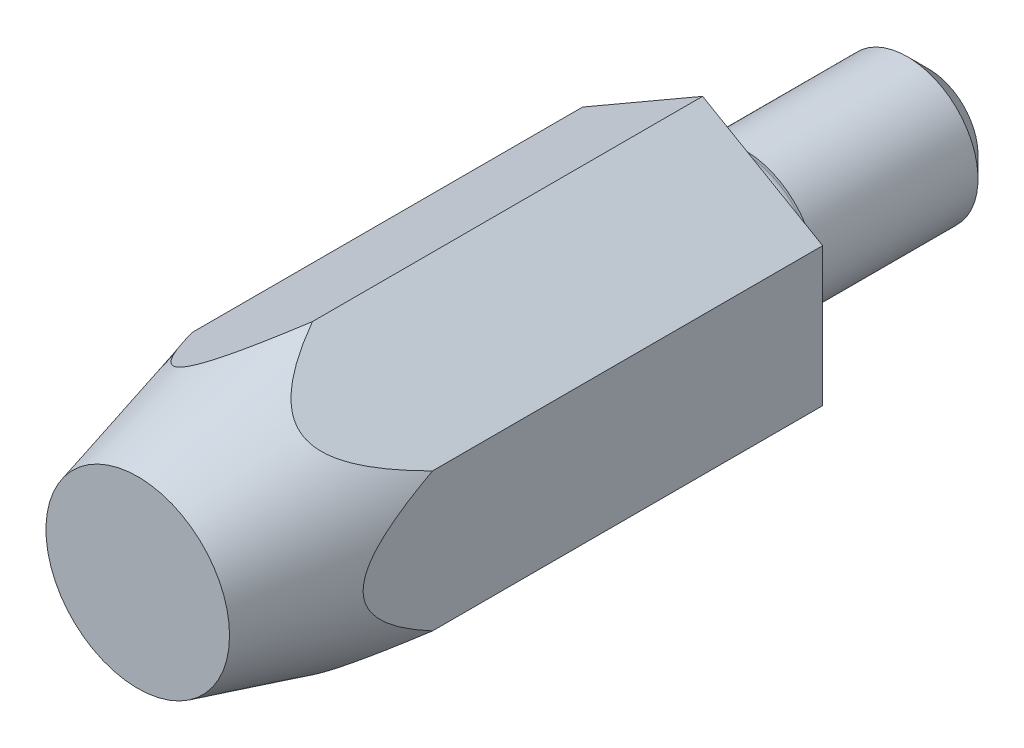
ISO-10303-21;
HEADER;
FILE_DESCRIPTION(('STEP AP214'),'2;1');
FILE_NAME('part.step','',(''),(''),'','','');
FILE_SCHEMA(('AUTOMOTIVE_DESIGN { 1 0 10303 214 1 1 1 1 }'));
ENDSEC;
DATA;
#1=APPLICATION_CONTEXT('core data for automotive mechanical design processes');
#2=APPLICATION_PROTOCOL_DEFINITION('international standard','automotive_design',2000,#1);
#3=PRODUCT_CONTEXT('',#1,'mechanical');
#4=PRODUCT('Part','Part','',(#3));
#5=PRODUCT_RELATED_PRODUCT_CATEGORY('part','',(#4));
#6=PRODUCT_DEFINITION_FORMATION('','',#4);
#7=PRODUCT_DEFINITION_CONTEXT('part definition',#1,'design');
#8=PRODUCT_DEFINITION('design','',#6,#7);
#9=PRODUCT_DEFINITION_SHAPE('','',#8);
#10=(LENGTH_UNIT() NAMED_UNIT(*) SI_UNIT(.MILLI.,.METRE.));
#11=(NAMED_UNIT(*) PLANE_ANGLE_UNIT() SI_UNIT($,.RADIAN.));
#12=(NAMED_UNIT(*) SI_UNIT($,.STERADIAN.) SOLID_ANGLE_UNIT());
#13=UNCERTAINTY_MEASURE_WITH_UNIT(LENGTH_MEASURE(1.E-05),#10,'distance_accuracy_value','');
#14=(GEOMETRIC_REPRESENTATION_CONTEXT(3) GLOBAL_UNCERTAINTY_ASSIGNED_CONTEXT((#13)) GLOBAL_UNIT_ASSIGNED_CONTEXT((#10,
#11,#12)) REPRESENTATION_CONTEXT('',''));
#15=CARTESIAN_POINT('',(0.,0.,0.));
#16=DIRECTION('',(0.,0.,1.));
#17=DIRECTION('',(1.,0.,0.));
#18=AXIS2_PLACEMENT_3D('',#15,#16,#17);
#19=CARTESIAN_POINT('',(-17.2179676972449,0.,0.));
#20=DIRECTION('',(0.,0.,-1.));
#21=DIRECTION('',(-1.,0.,0.));
#22=AXIS2_PLACEMENT_3D('',#19,#20,#21);
#23=PLANE('',#22);
#24=CARTESIAN_POINT('',(0.,0.,0.));
#25=DIRECTION('',(0.,0.,-1.));
#26=DIRECTION('',(-1.,0.,0.));
#27=AXIS2_PLACEMENT_3D('',#24,#25,#26);
#28=CIRCLE('',#27,4.8);
#29=CARTESIAN_POINT('',(-4.8,0.,0.));
#30=VERTEX_POINT('',#29);
#31=EDGE_CURVE('E22',#30,#30,#28,.F.);
#32=ORIENTED_EDGE('',*,*,#31,.T.);
#33=EDGE_LOOP('',(#32));
#34=FACE_BOUND('',#33,.T.);
#35=DIRECTION('',(0.,1.,0.));
#36=VECTOR('',#35,1.);
#37=CARTESIAN_POINT('',(8.5,-4.90747728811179,0.));
#38=LINE('',#37,#36);
#39=CARTESIAN_POINT('',(8.5,-4.90747728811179,0.));
#40=VERTEX_POINT('',#39);
#41=CARTESIAN_POINT('',(8.5,4.90747728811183,0.));
#42=VERTEX_POINT('',#41);
#43=EDGE_CURVE('E97',#40,#42,#38,.T.);
#44=ORIENTED_EDGE('',*,*,#43,.F.);
#45=DIRECTION('',(-0.866025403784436,-0.5,0.));
#46=VECTOR('',#45,1.);
#47=CARTESIAN_POINT('',(8.5,-4.90747728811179,0.));
#48=LINE('',#47,#46);
#49=CARTESIAN_POINT('',(0.,-9.81495457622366,0.));
#50=VERTEX_POINT('',#49);
#51=EDGE_CURVE('E90',#40,#50,#48,.T.);
#52=ORIENTED_EDGE('',*,*,#51,.T.);
#53=DIRECTION('',(0.866025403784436,-0.5,0.));
#54=VECTOR('',#53,1.);
#55=CARTESIAN_POINT('',(-8.5,-4.90747728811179,0.));
#56=LINE('',#55,#54);
#57=CARTESIAN_POINT('',(-8.5,-4.90747728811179,0.));
#58=VERTEX_POINT('',#57);
#59=EDGE_CURVE('E88',#58,#50,#56,.T.);
#60=ORIENTED_EDGE('',*,*,#59,.F.);
#61=DIRECTION('',(0.,1.,0.));
#62=VECTOR('',#61,1.);
#63=CARTESIAN_POINT('',(-8.5,-4.90747728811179,0.));
#64=LINE('',#63,#62);
#65=CARTESIAN_POINT('',(-8.5,4.90747728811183,0.));
#66=VERTEX_POINT('',#65);
#67=EDGE_CURVE('E37',#58,#66,#64,.T.);
#68=ORIENTED_EDGE('',*,*,#67,.T.);
#69=DIRECTION('',(0.86602540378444,0.5,0.));
#70=VECTOR('',#69,1.);
#71=CARTESIAN_POINT('',(-8.5,4.90747728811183,0.));
#72=LINE('',#71,#70);
#73=CARTESIAN_POINT('',(0.,9.81495457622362,0.));
#74=VERTEX_POINT('',#73);
#75=EDGE_CURVE('E77',#66,#74,#72,.T.);
#76=ORIENTED_EDGE('',*,*,#75,.T.);
#77=DIRECTION('',(-0.86602540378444,0.5,0.));
#78=VECTOR('',#77,1.);
#79=CARTESIAN_POINT('',(8.5,4.90747728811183,0.));
#80=LINE('',#79,#78);
#81=EDGE_CURVE('E83',#42,#74,#80,.T.);
#82=ORIENTED_EDGE('',*,*,#81,.F.);
#83=EDGE_LOOP('',(#44,#52,#60,#68,#76,#82));
#84=FACE_BOUND('',#83,.T.);
#85=ADVANCED_FACE('F14',(#34,#84),#23,.T.);
#86=CARTESIAN_POINT('',(8.5,-4.90747728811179,40.));
#87=DIRECTION('',(0.5,-0.866025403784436,0.));
#88=DIRECTION('',(0.866025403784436,0.5,0.));
#89=AXIS2_PLACEMENT_3D('',#86,#87,#88);
#90=PLANE('',#89);
#91=DIRECTION('',(0.,0.,-1.));
#92=VECTOR('',#91,1.);
#93=CARTESIAN_POINT('',(0.,-9.81495457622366,40.));
#94=LINE('',#93,#92);
#95=CARTESIAN_POINT('',(0.,-9.8149545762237,27.6284210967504));
#96=VERTEX_POINT('',#95);
#97=EDGE_CURVE('E29',#96,#50,#94,.T.);
#98=ORIENTED_EDGE('',*,*,#97,.T.);
#99=ORIENTED_EDGE('',*,*,#51,.F.);
#100=DIRECTION('',(0.,0.,-1.));
#101=VECTOR('',#100,1.);
#102=CARTESIAN_POINT('',(8.5,-4.90747728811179,40.));
#103=LINE('',#102,#101);
#104=CARTESIAN_POINT('',(8.5,-4.90747728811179,27.6284210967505));
#105=VERTEX_POINT('',#104);
#106=EDGE_CURVE('E102',#105,#40,#103,.T.);
#107=ORIENTED_EDGE('',*,*,#106,.F.);
#108=CARTESIAN_POINT('',(-0.000200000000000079,-9.8150700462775,27.6279901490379));
#109=CARTESIAN_POINT('',(0.0565623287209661,-9.7822983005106,27.7502929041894));
#110=CARTESIAN_POINT('',(0.1139809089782,-9.74914766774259,27.8721885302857));
#111=CARTESIAN_POINT('',(0.230282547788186,-9.68200088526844,28.1150576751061));
#112=CARTESIAN_POINT('',(0.289165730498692,-9.64800466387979,28.2360311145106));
#113=CARTESIAN_POINT('',(0.468440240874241,-9.54450047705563,28.597808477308));
#114=CARTESIAN_POINT('',(0.591253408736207,-9.4735942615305,28.837028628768));
#115=CARTESIAN_POINT('',(0.84635466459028,-9.32631148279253,29.31259125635));
#116=CARTESIAN_POINT('',(0.978737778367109,-9.24988005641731,29.5488660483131));
#117=CARTESIAN_POINT('',(1.25378264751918,-9.09108282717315,30.0131621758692));
#118=CARTESIAN_POINT('',(1.39643609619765,-9.00872182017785,30.2411899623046));
#119=CARTESIAN_POINT('',(1.61637758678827,-8.88173854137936,30.5679844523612));
#120=CARTESIAN_POINT('',(1.68842753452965,-8.84014048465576,30.6714546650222));
#121=CARTESIAN_POINT('',(1.83600172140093,-8.75493848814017,30.8750743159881));
#122=CARTESIAN_POINT('',(1.91152636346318,-8.71133431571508,30.9752233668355));
#123=CARTESIAN_POINT('',(2.06649578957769,-8.62186267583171,31.1713042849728));
#124=CARTESIAN_POINT('',(2.14593801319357,-8.57599668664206,31.2672388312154));
#125=CARTESIAN_POINT('',(2.3093516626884,-8.48164977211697,31.4537883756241));
#126=CARTESIAN_POINT('',(2.39332214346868,-8.43316939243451,31.5444044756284));
#127=CARTESIAN_POINT('',(2.61555054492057,-8.30486576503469,31.7683512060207));
#128=CARTESIAN_POINT('',(2.75760492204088,-8.22285063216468,31.8967851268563));
#129=CARTESIAN_POINT('',(3.05665849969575,-8.05019196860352,32.1279669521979));
#130=CARTESIAN_POINT('',(3.21361248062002,-7.95957454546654,32.2307893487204));
#131=CARTESIAN_POINT('',(3.4880775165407,-7.80111208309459,32.3698897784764));
#132=CARTESIAN_POINT('',(3.60143379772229,-7.73566580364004,32.4169283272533));
#133=CARTESIAN_POINT('',(3.83329039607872,-7.60180333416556,32.4889998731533));
#134=CARTESIAN_POINT('',(3.95178366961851,-7.53339121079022,32.5140620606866));
#135=CARTESIAN_POINT('',(4.1914950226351,-7.39499379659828,32.53911377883));
#136=CARTESIAN_POINT('',(4.31272475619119,-7.32500177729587,32.5389600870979));
#137=CARTESIAN_POINT('',(4.5531322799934,-7.18620242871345,32.5132499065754));
#138=CARTESIAN_POINT('',(4.6723087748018,-7.11739584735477,32.4876779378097));
#139=CARTESIAN_POINT('',(4.92988312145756,-6.96868522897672,32.4066601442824));
#140=CARTESIAN_POINT('',(5.06703611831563,-6.88949990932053,32.3460526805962));
#141=CARTESIAN_POINT('',(5.33126816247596,-6.73694546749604,32.2005195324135));
#142=CARTESIAN_POINT('',(5.45832337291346,-6.66359010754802,32.1155383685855));
#143=CARTESIAN_POINT('',(5.68877154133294,-6.53054079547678,31.9389162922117));
#144=CARTESIAN_POINT('',(5.79322360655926,-6.47023536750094,31.8490725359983));
#145=CARTESIAN_POINT('',(5.99515319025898,-6.35365126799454,31.65938757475));
#146=CARTESIAN_POINT('',(6.09262434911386,-6.29737626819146,31.5595374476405));
#147=CARTESIAN_POINT('',(6.28210577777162,-6.18797911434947,31.3517412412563));
#148=CARTESIAN_POINT('',(6.37407283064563,-6.13488191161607,31.243743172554));
#149=CARTESIAN_POINT('',(6.55266303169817,-6.03177281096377,31.0221313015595));
#150=CARTESIAN_POINT('',(6.63928830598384,-5.98175968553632,30.9085197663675));
#151=CARTESIAN_POINT('',(6.81304306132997,-5.88144233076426,30.6700093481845));
#152=CARTESIAN_POINT('',(6.89989417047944,-5.83129881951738,30.5448414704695));
#153=CARTESIAN_POINT('',(7.06927236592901,-5.73350827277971,30.2906504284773));
#154=CARTESIAN_POINT('',(7.15179863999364,-5.68586170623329,30.1616265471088));
#155=CARTESIAN_POINT('',(7.39403516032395,-5.54600638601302,29.769676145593));
#156=CARTESIAN_POINT('',(7.5481896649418,-5.45700524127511,29.5021724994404));
#157=CARTESIAN_POINT('',(7.83980957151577,-5.28863840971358,28.9692196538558));
#158=CARTESIAN_POINT('',(7.97768204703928,-5.20903769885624,28.7040627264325));
#159=CARTESIAN_POINT('',(8.17815750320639,-5.09329314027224,28.3027238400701));
#160=CARTESIAN_POINT('',(8.24382448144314,-5.05538029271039,28.1685667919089));
#161=CARTESIAN_POINT('',(8.37333001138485,-4.980610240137,27.8991024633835));
#162=CARTESIAN_POINT('',(8.43716879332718,-4.94375290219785,27.7637953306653));
#163=CARTESIAN_POINT('',(8.50020000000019,-4.90736181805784,27.6279901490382));
#164=B_SPLINE_CURVE_WITH_KNOTS('',3,(#108,#109,#110,#111,#112,#113,#114,#115,#116,#117,#118,
#119,#120,#121,#122,#123,#124,#125,#126,#127,#128,#129,#130,#131,#132,#133,#134,#135,#136,#137,
#138,#139,#140,#141,#142,#143,#144,#145,#146,#147,#148,#149,#150,#151,#152,#153,#154,#155,#156,
#157,#158,#159,#160,#161,#162,#163),.UNSPECIFIED.,.F.,.F.,(4,2,2,2,2,2,2,2,2,2,2,2,2,2,2,2,2,2,
2,2,2,2,2,2,2,2,2,4),(0.,0.416269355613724,0.832574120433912,1.66668109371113,2.51067143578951,
3.35398666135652,3.75221416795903,4.15048797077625,4.54850483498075,4.94643894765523,
5.56989408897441,6.19151414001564,6.60723967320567,7.02241217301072,7.43994287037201,
7.8577280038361,8.36359455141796,8.87062181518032,9.32115341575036,9.77209036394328,
10.2261980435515,10.680123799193,11.1611365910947,11.6422393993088,12.6056109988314,
13.5332254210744,13.9955173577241,14.4577508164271),.UNSPECIFIED.);
#165=EDGE_CURVE('E157',#96,#105,#164,.T.);
#166=ORIENTED_EDGE('',*,*,#165,.F.);
#167=EDGE_LOOP('',(#98,#99,#107,#166));
#168=FACE_BOUND('',#167,.T.);
#169=ADVANCED_FACE('F127',(#168),#90,.T.);
#170=CARTESIAN_POINT('',(8.5,-4.90747728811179,40.));
#171=DIRECTION('',(-1.,0.,0.));
#172=DIRECTION('',(0.,0.,1.));
#173=AXIS2_PLACEMENT_3D('',#170,#171,#172);
#174=PLANE('',#173);
#175=CARTESIAN_POINT('',(8.5,-10.0492779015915,15.1371140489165));
#176=CARTESIAN_POINT('',(8.5,-9.85410268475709,15.6931227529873));
#177=CARTESIAN_POINT('',(8.5,-9.65689373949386,16.2484272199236));
#178=CARTESIAN_POINT('',(8.5,-9.2574134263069,17.3573298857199));
#179=CARTESIAN_POINT('',(8.5,-9.05514110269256,17.9109277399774));
#180=CARTESIAN_POINT('',(8.5,-8.64297065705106,19.0203269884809));
#181=CARTESIAN_POINT('',(8.5,-8.43302447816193,19.5761105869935));
#182=CARTESIAN_POINT('',(8.5,-8.00569416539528,20.6847309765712));
#183=CARTESIAN_POINT('',(8.5,-7.78831100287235,21.2375681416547));
#184=CARTESIAN_POINT('',(8.5,-7.31428291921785,22.4138820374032));
#185=CARTESIAN_POINT('',(8.5,-7.05629847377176,23.0368236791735));
#186=CARTESIAN_POINT('',(8.5,-6.65727992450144,23.9662373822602));
#187=CARTESIAN_POINT('',(8.5,-6.52223343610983,24.2752812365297));
#188=CARTESIAN_POINT('',(8.5,-6.24742270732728,24.891263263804));
#189=CARTESIAN_POINT('',(8.5,-6.10765855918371,25.1982014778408));
#190=CARTESIAN_POINT('',(8.5,-5.8230839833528,25.8082813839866));
#191=CARTESIAN_POINT('',(8.5,-5.67829533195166,26.1114332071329));
#192=CARTESIAN_POINT('',(8.5,-5.38201744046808,26.7144414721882));
#193=CARTESIAN_POINT('',(8.5,-5.23052852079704,27.0142980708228));
#194=CARTESIAN_POINT('',(8.5,-4.91942475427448,27.6094951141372));
#195=CARTESIAN_POINT('',(8.5,-4.75981607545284,27.9048387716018));
#196=CARTESIAN_POINT('',(8.5,-4.43029545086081,28.4896960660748));
#197=CARTESIAN_POINT('',(8.5,-4.26038599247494,28.7792110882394));
#198=CARTESIAN_POINT('',(8.5,-4.0133208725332,29.1784934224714));
#199=CARTESIAN_POINT('',(8.5,-3.94177652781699,29.2917388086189));
#200=CARTESIAN_POINT('',(8.5,-3.79628704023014,29.5166832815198));
#201=CARTESIAN_POINT('',(8.5,-3.72234180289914,29.6283823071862));
#202=CARTESIAN_POINT('',(8.5,-3.49635051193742,29.960962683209));
#203=CARTESIAN_POINT('',(8.5,-3.34026820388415,30.1791320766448));
#204=CARTESIAN_POINT('',(8.5,-3.01649832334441,30.6022478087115));
#205=CARTESIAN_POINT('',(8.5,-2.84899560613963,30.8073327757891));
#206=CARTESIAN_POINT('',(8.5,-2.58473089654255,31.1031284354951));
#207=CARTESIAN_POINT('',(8.5,-2.49453248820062,31.1997003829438));
#208=CARTESIAN_POINT('',(8.5,-2.30911453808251,31.3878742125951));
#209=CARTESIAN_POINT('',(8.5,-2.2138969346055,31.4794779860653));
#210=CARTESIAN_POINT('',(8.5,-2.05038700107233,31.6268722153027));
#211=CARTESIAN_POINT('',(8.5,-1.98368987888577,31.6844287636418));
#212=CARTESIAN_POINT('',(8.5,-1.84752379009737,31.7961520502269));
#213=CARTESIAN_POINT('',(8.5,-1.77805484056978,31.8503188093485));
#214=CARTESIAN_POINT('',(8.5,-1.56493820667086,32.006937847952));
#215=CARTESIAN_POINT('',(8.5,-1.41671836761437,32.1033813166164));
#216=CARTESIAN_POINT('',(8.5,-1.10470500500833,32.2743652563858));
#217=CARTESIAN_POINT('',(8.5,-0.940703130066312,32.3485372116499));
#218=CARTESIAN_POINT('',(8.5,-0.601287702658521,32.4627994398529));
#219=CARTESIAN_POINT('',(8.5,-0.425917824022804,32.50301268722));
#220=CARTESIAN_POINT('',(8.5,-0.0937916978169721,32.5392021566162));
#221=CARTESIAN_POINT('',(8.5,0.0623969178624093,32.5402790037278));
#222=CARTESIAN_POINT('',(8.5,0.371765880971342,32.5108305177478));
#223=CARTESIAN_POINT('',(8.5,0.524943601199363,32.4802787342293));
#224=CARTESIAN_POINT('',(8.5,0.840158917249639,32.3873309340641));
#225=CARTESIAN_POINT('',(8.5,1.00120736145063,32.3216936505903));
#226=CARTESIAN_POINT('',(8.5,1.31095143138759,32.1659734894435));
#227=CARTESIAN_POINT('',(8.5,1.459620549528,32.0758398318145));
#228=CARTESIAN_POINT('',(8.5,1.73193848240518,31.8875729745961));
#229=CARTESIAN_POINT('',(8.5,1.85663291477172,31.7909153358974));
#230=CARTESIAN_POINT('',(8.5,2.09742681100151,31.5873351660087));
#231=CARTESIAN_POINT('',(8.5,2.21351826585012,31.4804032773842));
#232=CARTESIAN_POINT('',(8.5,2.43921615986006,31.258087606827));
#233=CARTESIAN_POINT('',(8.5,2.54875764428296,31.1426385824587));
#234=CARTESIAN_POINT('',(8.5,2.76135549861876,30.906071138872));
#235=CARTESIAN_POINT('',(8.5,2.86441532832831,30.7849558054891));
#236=CARTESIAN_POINT('',(8.5,3.06040356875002,30.5440656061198));
#237=CARTESIAN_POINT('',(8.5,3.15358031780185,30.4244915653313));
#238=CARTESIAN_POINT('',(8.5,3.33567224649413,30.1821333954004));
#239=CARTESIAN_POINT('',(8.5,3.42458689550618,30.0593488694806));
#240=CARTESIAN_POINT('',(8.5,3.6859133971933,29.6869848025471));
#241=CARTESIAN_POINT('',(8.5,3.8528020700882,29.4335279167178));
#242=CARTESIAN_POINT('',(8.5,4.17583930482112,28.9186833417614));
#243=CARTESIAN_POINT('',(8.5,4.33194695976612,28.6572703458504));
#244=CARTESIAN_POINT('',(8.5,4.63518718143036,28.129267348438));
#245=CARTESIAN_POINT('',(8.5,4.78231859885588,27.8626766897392));
#246=CARTESIAN_POINT('',(8.5,5.05827691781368,27.3462810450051));
#247=CARTESIAN_POINT('',(8.5,5.18764137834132,27.0967616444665));
#248=CARTESIAN_POINT('',(8.5,5.44120419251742,26.5950854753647));
#249=CARTESIAN_POINT('',(8.5,5.56540201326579,26.3429284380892));
#250=CARTESIAN_POINT('',(8.5,5.80836145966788,25.8386951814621));
#251=CARTESIAN_POINT('',(8.5,5.92716075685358,25.5866370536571));
#252=CARTESIAN_POINT('',(8.5,6.1610087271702,25.0808532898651));
#253=CARTESIAN_POINT('',(8.5,6.27605823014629,24.8271280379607));
#254=CARTESIAN_POINT('',(8.5,6.38953763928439,24.5727135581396));
#255=B_SPLINE_CURVE_WITH_KNOTS('',3,(#175,#176,#177,#178,#179,#180,#181,#182,#183,#184,#185,
#186,#187,#188,#189,#190,#191,#192,#193,#194,#195,#196,#197,#198,#199,#200,#201,#202,#203,#204,
#205,#206,#207,#208,#209,#210,#211,#212,#213,#214,#215,#216,#217,#218,#219,#220,#221,#222,#223,
#224,#225,#226,#227,#228,#229,#230,#231,#232,#233,#234,#235,#236,#237,#238,#239,#240,#241,#242,
#243,#244,#245,#246,#247,#248,#249,#250,#251,#252,#253,#254),.UNSPECIFIED.,.F.,.F.,(4,2,2,2,2,2,
2,2,2,2,2,2,2,2,2,2,2,2,2,2,2,2,2,2,2,2,2,2,2,2,2,2,2,2,2,2,2,2,2,4),(0.,1.76781912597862,
3.53597447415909,5.31827341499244,7.10034044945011,9.12289522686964,10.1346507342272,
11.1463864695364,12.1541813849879,13.1619281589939,14.16892052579,15.1756706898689,
15.5775005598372,15.9793462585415,16.7837234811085,17.5772549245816,17.9735433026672,
18.3696797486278,18.6338730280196,18.8980646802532,19.4270081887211,19.9642744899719,
20.4995867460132,20.9648417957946,21.4304862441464,21.949365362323,22.4693284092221,
22.941949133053,23.4150044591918,23.8921613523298,24.3690613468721,24.8237242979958,
25.2784437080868,26.1883916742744,27.1016215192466,28.0149680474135,28.8580823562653,
29.7012834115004,30.5372058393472,31.3729420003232),.UNSPECIFIED.);
#256=CARTESIAN_POINT('',(8.5,4.90747728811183,27.6284210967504));
#257=VERTEX_POINT('',#256);
#258=EDGE_CURVE('E151',#257,#105,#255,.F.);
#259=ORIENTED_EDGE('',*,*,#258,.T.);
#260=ORIENTED_EDGE('',*,*,#106,.T.);
#261=ORIENTED_EDGE('',*,*,#43,.T.);
#262=DIRECTION('',(0.,0.,-1.));
#263=VECTOR('',#262,1.);
#264=CARTESIAN_POINT('',(8.5,4.90747728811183,40.));
#265=LINE('',#264,#263);
#266=EDGE_CURVE('E100',#257,#42,#265,.T.);
#267=ORIENTED_EDGE('',*,*,#266,.F.);
#268=EDGE_LOOP('',(#259,#260,#261,#267));
#269=FACE_BOUND('',#268,.T.);
#270=ADVANCED_FACE('F163',(#269),#174,.F.);
#271=CARTESIAN_POINT('',(8.5,4.90747728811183,40.));
#272=DIRECTION('',(-0.5,-0.86602540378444,0.));
#273=DIRECTION('',(0.86602540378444,-0.5,0.));
#274=AXIS2_PLACEMENT_3D('',#271,#272,#273);
#275=PLANE('',#274);
#276=CARTESIAN_POINT('',(-0.000200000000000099,9.81507004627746,27.6279901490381));
#277=CARTESIAN_POINT('',(0.0565623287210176,9.78229830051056,27.7502929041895));
#278=CARTESIAN_POINT('',(0.113980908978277,9.74914766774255,27.8721885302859));
#279=CARTESIAN_POINT('',(0.230282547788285,9.6820008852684,28.1150576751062));
#280=CARTESIAN_POINT('',(0.289165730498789,9.64800466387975,28.2360311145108));
#281=CARTESIAN_POINT('',(0.468440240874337,9.54450047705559,28.5978084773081));
#282=CARTESIAN_POINT('',(0.591253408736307,9.47359426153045,28.8370286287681));
#283=CARTESIAN_POINT('',(0.84635466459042,9.32631148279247,29.3125912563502));
#284=CARTESIAN_POINT('',(0.978737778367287,9.24988005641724,29.5488660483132));
#285=CARTESIAN_POINT('',(1.25378264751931,9.09108282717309,30.0131621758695));
#286=CARTESIAN_POINT('',(1.39643609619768,9.00872182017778,30.2411899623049));
#287=CARTESIAN_POINT('',(1.61637758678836,8.8817385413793,30.5679844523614));
#288=CARTESIAN_POINT('',(1.68842753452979,8.84014048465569,30.6714546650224));
#289=CARTESIAN_POINT('',(1.83600172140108,8.75493848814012,30.8750743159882));
#290=CARTESIAN_POINT('',(1.91152636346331,8.71133431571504,30.9752233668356));
#291=CARTESIAN_POINT('',(2.0664957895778,8.62186267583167,31.1713042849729));
#292=CARTESIAN_POINT('',(2.14593801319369,8.57599668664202,31.2672388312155));
#293=CARTESIAN_POINT('',(2.30935166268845,8.48164977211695,31.4537883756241));
#294=CARTESIAN_POINT('',(2.39332214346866,8.43316939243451,31.5444044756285));
#295=CARTESIAN_POINT('',(2.6155505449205,8.30486576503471,31.7683512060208));
#296=CARTESIAN_POINT('',(2.75760492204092,8.22285063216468,31.8967851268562));
#297=CARTESIAN_POINT('',(3.05665849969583,8.0501919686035,32.1279669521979));
#298=CARTESIAN_POINT('',(3.21361248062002,7.95957454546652,32.2307893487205));
#299=CARTESIAN_POINT('',(3.48807751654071,7.80111208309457,32.3698897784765));
#300=CARTESIAN_POINT('',(3.60143379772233,7.73566580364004,32.4169283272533));
#301=CARTESIAN_POINT('',(3.83329039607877,7.60180333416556,32.4889998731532));
#302=CARTESIAN_POINT('',(3.95178366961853,7.53339121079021,32.5140620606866));
#303=CARTESIAN_POINT('',(4.19149502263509,7.39499379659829,32.53911377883));
#304=CARTESIAN_POINT('',(4.3127247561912,7.3250017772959,32.5389600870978));
#305=CARTESIAN_POINT('',(4.55313227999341,7.18620242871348,32.5132499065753));
#306=CARTESIAN_POINT('',(4.6723087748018,7.11739584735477,32.4876779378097));
#307=CARTESIAN_POINT('',(4.92988312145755,6.96868522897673,32.4066601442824));
#308=CARTESIAN_POINT('',(5.06703611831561,6.88949990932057,32.3460526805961));
#309=CARTESIAN_POINT('',(5.33126816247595,6.73694546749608,32.2005195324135));
#310=CARTESIAN_POINT('',(5.45832337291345,6.66359010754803,32.1155383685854));
#311=CARTESIAN_POINT('',(5.68877154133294,6.53054079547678,31.9389162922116));
#312=CARTESIAN_POINT('',(5.79322360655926,6.47023536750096,31.8490725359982));
#313=CARTESIAN_POINT('',(5.99515319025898,6.35365126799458,31.6593875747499));
#314=CARTESIAN_POINT('',(6.09262434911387,6.29737626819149,31.5595374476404));
#315=CARTESIAN_POINT('',(6.28210577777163,6.18797911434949,31.3517412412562));
#316=CARTESIAN_POINT('',(6.37407283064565,6.1348819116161,31.2437431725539));
#317=CARTESIAN_POINT('',(6.55266303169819,6.03177281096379,31.0221313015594));
#318=CARTESIAN_POINT('',(6.63928830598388,5.98175968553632,30.9085197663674));
#319=CARTESIAN_POINT('',(6.81304306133,5.88144233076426,30.6700093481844));
#320=CARTESIAN_POINT('',(6.89989417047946,5.8312988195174,30.5448414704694));
#321=CARTESIAN_POINT('',(7.06927236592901,5.73350827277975,30.2906504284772));
#322=CARTESIAN_POINT('',(7.15179863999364,5.68586170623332,30.1616265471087));
#323=CARTESIAN_POINT('',(7.39403516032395,5.54600638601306,29.7696761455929));
#324=CARTESIAN_POINT('',(7.54818966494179,5.45700524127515,29.5021724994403));
#325=CARTESIAN_POINT('',(7.83980957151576,5.28863840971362,28.9692196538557));
#326=CARTESIAN_POINT('',(7.97768204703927,5.20903769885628,28.7040627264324));
#327=CARTESIAN_POINT('',(8.17815750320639,5.09329314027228,28.30272384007));
#328=CARTESIAN_POINT('',(8.24382448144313,5.05538029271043,28.1685667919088));
#329=CARTESIAN_POINT('',(8.37333001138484,4.98061024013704,27.8991024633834));
#330=CARTESIAN_POINT('',(8.43716879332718,4.94375290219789,27.7637953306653));
#331=CARTESIAN_POINT('',(8.5002000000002,4.90736181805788,27.6279901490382));
#332=B_SPLINE_CURVE_WITH_KNOTS('',3,(#276,#277,#278,#279,#280,#281,#282,#283,#284,#285,#286,
#287,#288,#289,#290,#291,#292,#293,#294,#295,#296,#297,#298,#299,#300,#301,#302,#303,#304,#305,
#306,#307,#308,#309,#310,#311,#312,#313,#314,#315,#316,#317,#318,#319,#320,#321,#322,#323,#324,
#325,#326,#327,#328,#329,#330,#331),.UNSPECIFIED.,.F.,.F.,(4,2,2,2,2,2,2,2,2,2,2,2,2,2,2,2,2,2,
2,2,2,2,2,2,2,2,2,4),(0.,0.416269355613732,0.832574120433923,1.66668109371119,2.51067143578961,
3.35398666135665,3.75221416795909,4.15048797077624,4.54850483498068,4.94643894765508,
5.56989408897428,6.19151414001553,6.60723967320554,7.02241217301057,7.43994287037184,
7.85772800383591,8.36359455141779,8.87062181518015,9.3211534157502,9.77209036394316,
10.2261980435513,10.6801237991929,11.1611365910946,11.6422393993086,12.6056109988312,
13.5332254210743,13.9955173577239,14.4577508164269),.UNSPECIFIED.);
#333=CARTESIAN_POINT('',(0.,9.81495457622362,27.6284210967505));
#334=VERTEX_POINT('',#333);
#335=EDGE_CURVE('E145',#334,#257,#332,.T.);
#336=ORIENTED_EDGE('',*,*,#335,.T.);
#337=ORIENTED_EDGE('',*,*,#266,.T.);
#338=ORIENTED_EDGE('',*,*,#81,.T.);
#339=DIRECTION('',(0.,0.,-1.));
#340=VECTOR('',#339,1.);
#341=CARTESIAN_POINT('',(0.,9.81495457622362,40.));
#342=LINE('',#341,#340);
#343=EDGE_CURVE('E73',#334,#74,#342,.T.);
#344=ORIENTED_EDGE('',*,*,#343,.F.);
#345=EDGE_LOOP('',(#336,#337,#338,#344));
#346=FACE_BOUND('',#345,.T.);
#347=ADVANCED_FACE('F136',(#346),#275,.F.);
#348=CARTESIAN_POINT('',(-8.5,4.90747728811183,40.));
#349=DIRECTION('',(-0.5,0.86602540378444,0.));
#350=DIRECTION('',(-0.86602540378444,-0.5,0.));
#351=AXIS2_PLACEMENT_3D('',#348,#349,#350);
#352=PLANE('',#351);
#353=ORIENTED_EDGE('',*,*,#343,.T.);
#354=ORIENTED_EDGE('',*,*,#75,.F.);
#355=DIRECTION('',(0.,0.,-1.));
#356=VECTOR('',#355,1.);
#357=CARTESIAN_POINT('',(-8.5,4.90747728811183,40.));
#358=LINE('',#357,#356);
#359=CARTESIAN_POINT('',(-8.5,4.90747728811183,27.6284210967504));
#360=VERTEX_POINT('',#359);
#361=EDGE_CURVE('E66',#360,#66,#358,.T.);
#362=ORIENTED_EDGE('',*,*,#361,.F.);
#363=CARTESIAN_POINT('',(0.0001999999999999,9.81507004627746,27.6279901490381));
#364=CARTESIAN_POINT('',(-0.0565623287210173,9.78229830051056,27.7502929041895));
#365=CARTESIAN_POINT('',(-0.113980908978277,9.74914766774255,27.8721885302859));
#366=CARTESIAN_POINT('',(-0.230282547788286,9.6820008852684,28.1150576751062));
#367=CARTESIAN_POINT('',(-0.28916573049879,9.64800466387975,28.2360311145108));
#368=CARTESIAN_POINT('',(-0.468440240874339,9.54450047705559,28.5978084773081));
#369=CARTESIAN_POINT('',(-0.591253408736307,9.47359426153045,28.8370286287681));
#370=CARTESIAN_POINT('',(-0.84635466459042,9.32631148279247,29.3125912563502));
#371=CARTESIAN_POINT('',(-0.978737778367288,9.24988005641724,29.5488660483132));
#372=CARTESIAN_POINT('',(-1.25378264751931,9.09108282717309,30.0131621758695));
#373=CARTESIAN_POINT('',(-1.39643609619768,9.00872182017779,30.2411899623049));
#374=CARTESIAN_POINT('',(-1.61637758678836,8.88173854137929,30.5679844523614));
#375=CARTESIAN_POINT('',(-1.68842753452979,8.84014048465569,30.6714546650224));
#376=CARTESIAN_POINT('',(-1.83600172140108,8.75493848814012,30.8750743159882));
#377=CARTESIAN_POINT('',(-1.91152636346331,8.71133431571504,30.9752233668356));
#378=CARTESIAN_POINT('',(-2.0664957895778,8.62186267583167,31.1713042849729));
#379=CARTESIAN_POINT('',(-2.14593801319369,8.57599668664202,31.2672388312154));
#380=CARTESIAN_POINT('',(-2.30935166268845,8.48164977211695,31.4537883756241));
#381=CARTESIAN_POINT('',(-2.39332214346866,8.43316939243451,31.5444044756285));
#382=CARTESIAN_POINT('',(-2.6155505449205,8.30486576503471,31.7683512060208));
#383=CARTESIAN_POINT('',(-2.75760492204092,8.22285063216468,31.8967851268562));
#384=CARTESIAN_POINT('',(-3.05665849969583,8.0501919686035,32.1279669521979));
#385=CARTESIAN_POINT('',(-3.21361248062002,7.95957454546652,32.2307893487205));
#386=CARTESIAN_POINT('',(-3.48807751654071,7.80111208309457,32.3698897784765));
#387=CARTESIAN_POINT('',(-3.60143379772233,7.73566580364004,32.4169283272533));
#388=CARTESIAN_POINT('',(-3.83329039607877,7.60180333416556,32.4889998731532));
#389=CARTESIAN_POINT('',(-3.95178366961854,7.53339121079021,32.5140620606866));
#390=CARTESIAN_POINT('',(-4.1914950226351,7.39499379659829,32.53911377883));
#391=CARTESIAN_POINT('',(-4.3127247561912,7.32500177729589,32.5389600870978));
#392=CARTESIAN_POINT('',(-4.55313227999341,7.18620242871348,32.5132499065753));
#393=CARTESIAN_POINT('',(-4.67230877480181,7.11739584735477,32.4876779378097));
#394=CARTESIAN_POINT('',(-4.92988312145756,6.96868522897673,32.4066601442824));
#395=CARTESIAN_POINT('',(-5.06703611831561,6.88949990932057,32.3460526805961));
#396=CARTESIAN_POINT('',(-5.33126816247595,6.73694546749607,32.2005195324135));
#397=CARTESIAN_POINT('',(-5.45832337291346,6.66359010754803,32.1155383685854));
#398=CARTESIAN_POINT('',(-5.68877154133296,6.53054079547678,31.9389162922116));
#399=CARTESIAN_POINT('',(-5.79322360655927,6.47023536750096,31.8490725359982));
#400=CARTESIAN_POINT('',(-5.99515319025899,6.35365126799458,31.6593875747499));
#401=CARTESIAN_POINT('',(-6.09262434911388,6.29737626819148,31.5595374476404));
#402=CARTESIAN_POINT('',(-6.28210577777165,6.18797911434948,31.3517412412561));
#403=CARTESIAN_POINT('',(-6.37407283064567,6.13488191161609,31.2437431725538));
#404=CARTESIAN_POINT('',(-6.55266303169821,6.03177281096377,31.0221313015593));
#405=CARTESIAN_POINT('',(-6.63928830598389,5.98175968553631,30.9085197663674));
#406=CARTESIAN_POINT('',(-6.81304306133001,5.88144233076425,30.6700093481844));
#407=CARTESIAN_POINT('',(-6.89989417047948,5.83129881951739,30.5448414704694));
#408=CARTESIAN_POINT('',(-7.06927236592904,5.73350827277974,30.2906504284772));
#409=CARTESIAN_POINT('',(-7.15179863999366,5.68586170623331,30.1616265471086));
#410=CARTESIAN_POINT('',(-7.39403516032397,5.54600638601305,29.7696761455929));
#411=CARTESIAN_POINT('',(-7.54818966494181,5.45700524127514,29.5021724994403));
#412=CARTESIAN_POINT('',(-7.83980957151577,5.28863840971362,28.9692196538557));
#413=CARTESIAN_POINT('',(-7.97768204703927,5.20903769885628,28.7040627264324));
#414=CARTESIAN_POINT('',(-8.17815750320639,5.09329314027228,28.30272384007));
#415=CARTESIAN_POINT('',(-8.24382448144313,5.05538029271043,28.1685667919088));
#416=CARTESIAN_POINT('',(-8.37333001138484,4.98061024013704,27.8991024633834));
#417=CARTESIAN_POINT('',(-8.43716879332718,4.94375290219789,27.7637953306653));
#418=CARTESIAN_POINT('',(-8.50020000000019,4.90736181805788,27.6279901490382));
#419=B_SPLINE_CURVE_WITH_KNOTS('',3,(#363,#364,#365,#366,#367,#368,#369,#370,#371,#372,#373,
#374,#375,#376,#377,#378,#379,#380,#381,#382,#383,#384,#385,#386,#387,#388,#389,#390,#391,#392,
#393,#394,#395,#396,#397,#398,#399,#400,#401,#402,#403,#404,#405,#406,#407,#408,#409,#410,#411,
#412,#413,#414,#415,#416,#417,#418),.UNSPECIFIED.,.F.,.F.,(4,2,2,2,2,2,2,2,2,2,2,2,2,2,2,2,2,2,
2,2,2,2,2,2,2,2,2,4),(0.,0.416269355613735,0.832574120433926,1.66668109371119,2.51067143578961,
3.35398666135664,3.75221416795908,4.15048797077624,4.54850483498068,4.94643894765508,
5.56989408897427,6.19151414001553,6.60723967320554,7.02241217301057,7.43994287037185,
7.85772800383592,8.36359455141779,8.87062181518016,9.32115341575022,9.77209036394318,
10.2261980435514,10.6801237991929,11.1611365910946,11.6422393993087,12.6056109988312,
13.5332254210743,13.9955173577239,14.4577508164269),.UNSPECIFIED.);
#420=EDGE_CURVE('E139',#334,#360,#419,.T.);
#421=ORIENTED_EDGE('',*,*,#420,.F.);
#422=EDGE_LOOP('',(#353,#354,#362,#421));
#423=FACE_BOUND('',#422,.T.);
#424=ADVANCED_FACE('F78',(#423),#352,.T.);
#425=CARTESIAN_POINT('',(-8.5,-4.90747728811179,40.));
#426=DIRECTION('',(-1.,0.,0.));
#427=DIRECTION('',(0.,0.,1.));
#428=AXIS2_PLACEMENT_3D('',#425,#426,#427);
#429=PLANE('',#428);
#430=ORIENTED_EDGE('',*,*,#361,.T.);
#431=ORIENTED_EDGE('',*,*,#67,.F.);
#432=DIRECTION('',(0.,0.,-1.));
#433=VECTOR('',#432,1.);
#434=CARTESIAN_POINT('',(-8.5,-4.90747728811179,40.));
#435=LINE('',#434,#433);
#436=CARTESIAN_POINT('',(-8.5,-4.90747728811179,27.6284210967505));
#437=VERTEX_POINT('',#436);
#438=EDGE_CURVE('E74',#437,#58,#435,.T.);
#439=ORIENTED_EDGE('',*,*,#438,.F.);
#440=CARTESIAN_POINT('',(-8.5,-10.0492779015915,15.1371140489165));
#441=CARTESIAN_POINT('',(-8.5,-9.85410268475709,15.6931227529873));
#442=CARTESIAN_POINT('',(-8.5,-9.65689373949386,16.2484272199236));
#443=CARTESIAN_POINT('',(-8.5,-9.2574134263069,17.3573298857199));
#444=CARTESIAN_POINT('',(-8.5,-9.05514110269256,17.9109277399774));
#445=CARTESIAN_POINT('',(-8.5,-8.64297065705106,19.0203269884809));
#446=CARTESIAN_POINT('',(-8.5,-8.43302447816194,19.5761105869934));
#447=CARTESIAN_POINT('',(-8.5,-8.00569416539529,20.6847309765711));
#448=CARTESIAN_POINT('',(-8.5,-7.78831100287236,21.2375681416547));
#449=CARTESIAN_POINT('',(-8.5,-7.31428291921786,22.4138820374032));
#450=CARTESIAN_POINT('',(-8.5,-7.05629847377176,23.0368236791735));
#451=CARTESIAN_POINT('',(-8.5,-6.65727992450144,23.9662373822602));
#452=CARTESIAN_POINT('',(-8.5,-6.52223343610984,24.2752812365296));
#453=CARTESIAN_POINT('',(-8.5,-6.24742270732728,24.891263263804));
#454=CARTESIAN_POINT('',(-8.5,-6.10765855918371,25.1982014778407));
#455=CARTESIAN_POINT('',(-8.5,-5.82308398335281,25.8082813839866));
#456=CARTESIAN_POINT('',(-8.5,-5.67829533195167,26.1114332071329));
#457=CARTESIAN_POINT('',(-8.5,-5.38201744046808,26.7144414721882));
#458=CARTESIAN_POINT('',(-8.5,-5.23052852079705,27.0142980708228));
#459=CARTESIAN_POINT('',(-8.5,-4.91942475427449,27.6094951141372));
#460=CARTESIAN_POINT('',(-8.5,-4.75981607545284,27.9048387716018));
#461=CARTESIAN_POINT('',(-8.5,-4.43029545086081,28.4896960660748));
#462=CARTESIAN_POINT('',(-8.5,-4.26038599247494,28.7792110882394));
#463=CARTESIAN_POINT('',(-8.5,-4.01332087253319,29.1784934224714));
#464=CARTESIAN_POINT('',(-8.5,-3.94177652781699,29.2917388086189));
#465=CARTESIAN_POINT('',(-8.5,-3.79628704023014,29.5166832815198));
#466=CARTESIAN_POINT('',(-8.5,-3.72234180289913,29.6283823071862));
#467=CARTESIAN_POINT('',(-8.5,-3.49635051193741,29.9609626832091));
#468=CARTESIAN_POINT('',(-8.5,-3.34026820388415,30.1791320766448));
#469=CARTESIAN_POINT('',(-8.5,-3.0164983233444,30.6022478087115));
#470=CARTESIAN_POINT('',(-8.5,-2.84899560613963,30.8073327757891));
#471=CARTESIAN_POINT('',(-8.5,-2.58473089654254,31.1031284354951));
#472=CARTESIAN_POINT('',(-8.5,-2.49453248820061,31.1997003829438));
#473=CARTESIAN_POINT('',(-8.5,-2.30911453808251,31.3878742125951));
#474=CARTESIAN_POINT('',(-8.5,-2.2138969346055,31.4794779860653));
#475=CARTESIAN_POINT('',(-8.5,-2.05038700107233,31.6268722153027));
#476=CARTESIAN_POINT('',(-8.5,-1.98368987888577,31.6844287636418));
#477=CARTESIAN_POINT('',(-8.5,-1.84752379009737,31.7961520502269));
#478=CARTESIAN_POINT('',(-8.5,-1.77805484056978,31.8503188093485));
#479=CARTESIAN_POINT('',(-8.5,-1.56493820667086,32.006937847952));
#480=CARTESIAN_POINT('',(-8.5,-1.41671836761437,32.1033813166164));
#481=CARTESIAN_POINT('',(-8.5,-1.10470500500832,32.2743652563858));
#482=CARTESIAN_POINT('',(-8.5,-0.940703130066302,32.3485372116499));
#483=CARTESIAN_POINT('',(-8.5,-0.601287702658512,32.4627994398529));
#484=CARTESIAN_POINT('',(-8.5,-0.425917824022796,32.50301268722));
#485=CARTESIAN_POINT('',(-8.5,-0.0937916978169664,32.5392021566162));
#486=CARTESIAN_POINT('',(-8.5,0.0623969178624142,32.5402790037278));
#487=CARTESIAN_POINT('',(-8.5,0.371765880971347,32.5108305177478));
#488=CARTESIAN_POINT('',(-8.5,0.524943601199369,32.4802787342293));
#489=CARTESIAN_POINT('',(-8.5,0.840158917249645,32.3873309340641));
#490=CARTESIAN_POINT('',(-8.5,1.00120736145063,32.3216936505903));
#491=CARTESIAN_POINT('',(-8.5,1.3109514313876,32.1659734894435));
#492=CARTESIAN_POINT('',(-8.5,1.45962054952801,32.0758398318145));
#493=CARTESIAN_POINT('',(-8.5,1.73193848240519,31.8875729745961));
#494=CARTESIAN_POINT('',(-8.5,1.85663291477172,31.7909153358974));
#495=CARTESIAN_POINT('',(-8.5,2.09742681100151,31.5873351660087));
#496=CARTESIAN_POINT('',(-8.5,2.21351826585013,31.4804032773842));
#497=CARTESIAN_POINT('',(-8.5,2.43921615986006,31.258087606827));
#498=CARTESIAN_POINT('',(-8.5,2.54875764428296,31.1426385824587));
#499=CARTESIAN_POINT('',(-8.5,2.76135549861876,30.906071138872));
#500=CARTESIAN_POINT('',(-8.5,2.86441532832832,30.7849558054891));
#501=CARTESIAN_POINT('',(-8.5,3.06040356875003,30.5440656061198));
#502=CARTESIAN_POINT('',(-8.5,3.15358031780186,30.4244915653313));
#503=CARTESIAN_POINT('',(-8.5,3.33567224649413,30.1821333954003));
#504=CARTESIAN_POINT('',(-8.5,3.42458689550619,30.0593488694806));
#505=CARTESIAN_POINT('',(-8.5,3.68591339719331,29.686984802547));
#506=CARTESIAN_POINT('',(-8.5,3.85280207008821,29.4335279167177));
#507=CARTESIAN_POINT('',(-8.5,4.17583930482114,28.9186833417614));
#508=CARTESIAN_POINT('',(-8.5,4.33194695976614,28.6572703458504));
#509=CARTESIAN_POINT('',(-8.5,4.63518718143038,28.1292673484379));
#510=CARTESIAN_POINT('',(-8.5,4.78231859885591,27.8626766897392));
#511=CARTESIAN_POINT('',(-8.5,5.05827691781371,27.3462810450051));
#512=CARTESIAN_POINT('',(-8.5,5.18764137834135,27.0967616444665));
#513=CARTESIAN_POINT('',(-8.5,5.44120419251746,26.5950854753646));
#514=CARTESIAN_POINT('',(-8.5,5.56540201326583,26.3429284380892));
#515=CARTESIAN_POINT('',(-8.5,5.80836145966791,25.838695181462));
#516=CARTESIAN_POINT('',(-8.5,5.92716075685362,25.586637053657));
#517=CARTESIAN_POINT('',(-8.5,6.16100872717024,25.080853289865));
#518=CARTESIAN_POINT('',(-8.5,6.27605823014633,24.8271280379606));
#519=CARTESIAN_POINT('',(-8.5,6.38953763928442,24.5727135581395));
#520=B_SPLINE_CURVE_WITH_KNOTS('',3,(#440,#441,#442,#443,#444,#445,#446,#447,#448,#449,#450,
#451,#452,#453,#454,#455,#456,#457,#458,#459,#460,#461,#462,#463,#464,#465,#466,#467,#468,#469,
#470,#471,#472,#473,#474,#475,#476,#477,#478,#479,#480,#481,#482,#483,#484,#485,#486,#487,#488,
#489,#490,#491,#492,#493,#494,#495,#496,#497,#498,#499,#500,#501,#502,#503,#504,#505,#506,#507,
#508,#509,#510,#511,#512,#513,#514,#515,#516,#517,#518,#519),.UNSPECIFIED.,.F.,.F.,(4,2,2,2,2,2,
2,2,2,2,2,2,2,2,2,2,2,2,2,2,2,2,2,2,2,2,2,2,2,2,2,2,2,2,2,2,2,2,2,4),(0.,1.76781912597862,
3.53597447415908,5.31827341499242,7.10034044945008,9.12289522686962,10.1346507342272,
11.1463864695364,12.1541813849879,13.1619281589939,14.16892052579,15.1756706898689,
15.5775005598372,15.9793462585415,16.7837234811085,17.5772549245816,17.9735433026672,
18.3696797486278,18.6338730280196,18.8980646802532,19.4270081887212,19.9642744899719,
20.4995867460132,20.9648417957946,21.4304862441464,21.949365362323,22.4693284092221,
22.941949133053,23.4150044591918,23.8921613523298,24.3690613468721,24.8237242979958,
25.2784437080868,26.1883916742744,27.1016215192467,28.0149680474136,28.8580823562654,
29.7012834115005,30.5372058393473,31.3729420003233),.UNSPECIFIED.);
#521=EDGE_CURVE('E70',#360,#437,#520,.F.);
#522=ORIENTED_EDGE('',*,*,#521,.F.);
#523=EDGE_LOOP('',(#430,#431,#439,#522));
#524=FACE_BOUND('',#523,.T.);
#525=ADVANCED_FACE('F68',(#524),#429,.T.);
#526=CARTESIAN_POINT('',(-8.5,-4.90747728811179,40.));
#527=DIRECTION('',(0.5,0.866025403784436,0.));
#528=DIRECTION('',(-0.866025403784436,0.5,0.));
#529=AXIS2_PLACEMENT_3D('',#526,#527,#528);
#530=PLANE('',#529);
#531=CARTESIAN_POINT('',(0.000199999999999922,-9.8150700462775,27.6279901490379));
#532=CARTESIAN_POINT('',(-0.0565623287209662,-9.7822983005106,27.7502929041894));
#533=CARTESIAN_POINT('',(-0.1139809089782,-9.74914766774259,27.8721885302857));
#534=CARTESIAN_POINT('',(-0.230282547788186,-9.68200088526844,28.1150576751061));
#535=CARTESIAN_POINT('',(-0.289165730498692,-9.64800466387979,28.2360311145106));
#536=CARTESIAN_POINT('',(-0.46844024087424,-9.54450047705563,28.597808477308));
#537=CARTESIAN_POINT('',(-0.591253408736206,-9.4735942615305,28.837028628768));
#538=CARTESIAN_POINT('',(-0.846354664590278,-9.32631148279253,29.31259125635));
#539=CARTESIAN_POINT('',(-0.978737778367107,-9.2498800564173,29.5488660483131));
#540=CARTESIAN_POINT('',(-1.25378264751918,-9.09108282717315,30.0131621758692));
#541=CARTESIAN_POINT('',(-1.39643609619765,-9.00872182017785,30.2411899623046));
#542=CARTESIAN_POINT('',(-1.61637758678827,-8.88173854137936,30.5679844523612));
#543=CARTESIAN_POINT('',(-1.68842753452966,-8.84014048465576,30.6714546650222));
#544=CARTESIAN_POINT('',(-1.83600172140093,-8.75493848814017,30.8750743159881));
#545=CARTESIAN_POINT('',(-1.91152636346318,-8.71133431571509,30.9752233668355));
#546=CARTESIAN_POINT('',(-2.06649578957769,-8.62186267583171,31.1713042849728));
#547=CARTESIAN_POINT('',(-2.14593801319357,-8.57599668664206,31.2672388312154));
#548=CARTESIAN_POINT('',(-2.3093516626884,-8.48164977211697,31.4537883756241));
#549=CARTESIAN_POINT('',(-2.39332214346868,-8.43316939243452,31.5444044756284));
#550=CARTESIAN_POINT('',(-2.61555054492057,-8.3048657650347,31.7683512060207));
#551=CARTESIAN_POINT('',(-2.75760492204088,-8.22285063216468,31.8967851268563));
#552=CARTESIAN_POINT('',(-3.05665849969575,-8.05019196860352,32.1279669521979));
#553=CARTESIAN_POINT('',(-3.21361248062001,-7.95957454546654,32.2307893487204));
#554=CARTESIAN_POINT('',(-3.4880775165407,-7.80111208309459,32.3698897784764));
#555=CARTESIAN_POINT('',(-3.60143379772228,-7.73566580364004,32.4169283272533));
#556=CARTESIAN_POINT('',(-3.83329039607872,-7.60180333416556,32.4889998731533));
#557=CARTESIAN_POINT('',(-3.95178366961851,-7.53339121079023,32.5140620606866));
#558=CARTESIAN_POINT('',(-4.1914950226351,-7.39499379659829,32.53911377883));
#559=CARTESIAN_POINT('',(-4.31272475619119,-7.32500177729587,32.5389600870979));
#560=CARTESIAN_POINT('',(-4.5531322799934,-7.18620242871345,32.5132499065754));
#561=CARTESIAN_POINT('',(-4.6723087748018,-7.11739584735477,32.4876779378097));
#562=CARTESIAN_POINT('',(-4.92988312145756,-6.96868522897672,32.4066601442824));
#563=CARTESIAN_POINT('',(-5.06703611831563,-6.88949990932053,32.3460526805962));
#564=CARTESIAN_POINT('',(-5.33126816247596,-6.73694546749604,32.2005195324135));
#565=CARTESIAN_POINT('',(-5.45832337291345,-6.66359010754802,32.1155383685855));
#566=CARTESIAN_POINT('',(-5.68877154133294,-6.53054079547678,31.9389162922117));
#567=CARTESIAN_POINT('',(-5.79322360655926,-6.47023536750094,31.8490725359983));
#568=CARTESIAN_POINT('',(-5.99515319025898,-6.35365126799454,31.65938757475));
#569=CARTESIAN_POINT('',(-6.09262434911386,-6.29737626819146,31.5595374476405));
#570=CARTESIAN_POINT('',(-6.28210577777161,-6.18797911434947,31.3517412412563));
#571=CARTESIAN_POINT('',(-6.37407283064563,-6.13488191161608,31.243743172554));
#572=CARTESIAN_POINT('',(-6.55266303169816,-6.03177281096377,31.0221313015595));
#573=CARTESIAN_POINT('',(-6.63928830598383,-5.98175968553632,30.9085197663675));
#574=CARTESIAN_POINT('',(-6.81304306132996,-5.88144233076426,30.6700093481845));
#575=CARTESIAN_POINT('',(-6.89989417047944,-5.83129881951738,30.5448414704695));
#576=CARTESIAN_POINT('',(-7.06927236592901,-5.73350827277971,30.2906504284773));
#577=CARTESIAN_POINT('',(-7.15179863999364,-5.68586170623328,30.1616265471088));
#578=CARTESIAN_POINT('',(-7.39403516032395,-5.54600638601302,29.769676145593));
#579=CARTESIAN_POINT('',(-7.5481896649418,-5.45700524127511,29.5021724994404));
#580=CARTESIAN_POINT('',(-7.83980957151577,-5.28863840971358,28.9692196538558));
#581=CARTESIAN_POINT('',(-7.97768204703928,-5.20903769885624,28.7040627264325));
#582=CARTESIAN_POINT('',(-8.17815750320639,-5.09329314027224,28.30272384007));
#583=CARTESIAN_POINT('',(-8.24382448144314,-5.05538029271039,28.1685667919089));
#584=CARTESIAN_POINT('',(-8.37333001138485,-4.980610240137,27.8991024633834));
#585=CARTESIAN_POINT('',(-8.43716879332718,-4.94375290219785,27.7637953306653));
#586=CARTESIAN_POINT('',(-8.5002000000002,-4.90736181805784,27.6279901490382));
#587=B_SPLINE_CURVE_WITH_KNOTS('',3,(#531,#532,#533,#534,#535,#536,#537,#538,#539,#540,#541,
#542,#543,#544,#545,#546,#547,#548,#549,#550,#551,#552,#553,#554,#555,#556,#557,#558,#559,#560,
#561,#562,#563,#564,#565,#566,#567,#568,#569,#570,#571,#572,#573,#574,#575,#576,#577,#578,#579,
#580,#581,#582,#583,#584,#585,#586),.UNSPECIFIED.,.F.,.F.,(4,2,2,2,2,2,2,2,2,2,2,2,2,2,2,2,2,2,
2,2,2,2,2,2,2,2,2,4),(0.,0.416269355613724,0.832574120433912,1.66668109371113,2.51067143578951,
3.35398666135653,3.75221416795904,4.15048797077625,4.54850483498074,4.94643894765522,
5.5698940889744,6.19151414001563,6.60723967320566,7.02241217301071,7.43994287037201,
7.8577280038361,8.36359455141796,8.87062181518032,9.32115341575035,9.77209036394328,
10.2261980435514,10.680123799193,11.1611365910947,11.6422393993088,12.6056109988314,
13.5332254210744,13.9955173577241,14.4577508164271),.UNSPECIFIED.);
#588=EDGE_CURVE('E104',#96,#437,#587,.T.);
#589=ORIENTED_EDGE('',*,*,#588,.T.);
#590=ORIENTED_EDGE('',*,*,#438,.T.);
#591=ORIENTED_EDGE('',*,*,#59,.T.);
#592=ORIENTED_EDGE('',*,*,#97,.F.);
#593=EDGE_LOOP('',(#589,#590,#591,#592));
#594=FACE_BOUND('',#593,.T.);
#595=ADVANCED_FACE('F122',(#594),#530,.F.);
#596=CARTESIAN_POINT('',(0.,0.,40.));
#597=DIRECTION('',(0.,0.,1.));
#598=DIRECTION('',(1.,0.,0.));
#599=AXIS2_PLACEMENT_3D('',#596,#597,#598);
#600=PLANE('',#599);
#601=CARTESIAN_POINT('',(0.,0.,40.));
#602=DIRECTION('',(0.,0.,1.));
#603=DIRECTION('',(1.,0.,0.));
#604=AXIS2_PLACEMENT_3D('',#601,#602,#603);
#605=CIRCLE('',#604,6.5);
#606=CARTESIAN_POINT('',(6.5,0.,40.));
#607=VERTEX_POINT('',#606);
#608=EDGE_CURVE('E202',#607,#607,#605,.T.);
#609=ORIENTED_EDGE('',*,*,#608,.T.);
#610=EDGE_LOOP('',(#609));
#611=FACE_BOUND('',#610,.T.);
#612=ADVANCED_FACE('F126',(#611),#600,.T.);
#613=CARTESIAN_POINT('',(0.,0.,40.));
#614=DIRECTION('',(0.,0.,-1.));
#615=DIRECTION('',(-1.,0.,0.));
#616=AXIS2_PLACEMENT_3D('',#613,#614,#615);
#617=CONICAL_SURFACE('',#616,6.5,0.26179938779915);
#618=ORIENTED_EDGE('',*,*,#608,.F.);
#619=EDGE_LOOP('',(#618));
#620=FACE_BOUND('',#619,.T.);
#621=ORIENTED_EDGE('',*,*,#588,.F.);
#622=ORIENTED_EDGE('',*,*,#165,.T.);
#623=ORIENTED_EDGE('',*,*,#258,.F.);
#624=ORIENTED_EDGE('',*,*,#335,.F.);
#625=ORIENTED_EDGE('',*,*,#420,.T.);
#626=ORIENTED_EDGE('',*,*,#521,.T.);
#627=EDGE_LOOP('',(#621,#622,#623,#624,#625,#626));
#628=FACE_BOUND('',#627,.T.);
#629=ADVANCED_FACE('F118',(#620,#628),#617,.T.);
#630=CARTESIAN_POINT('',(0.,0.,-3.));
#631=DIRECTION('',(0.,0.,-1.));
#632=DIRECTION('',(-1.,0.,0.));
#633=AXIS2_PLACEMENT_3D('',#630,#631,#632);
#634=PLANE('',#633);
#635=CARTESIAN_POINT('',(0.,0.,-3.));
#636=DIRECTION('',(0.,0.,-1.));
#637=DIRECTION('',(-1.,0.,0.));
#638=AXIS2_PLACEMENT_3D('',#635,#636,#637);
#639=CIRCLE('',#638,4.8);
#640=CARTESIAN_POINT('',(-4.8,0.,-3.));
#641=VERTEX_POINT('',#640);
#642=EDGE_CURVE('E9',#641,#641,#639,.T.);
#643=ORIENTED_EDGE('',*,*,#642,.T.);
#644=EDGE_LOOP('',(#643));
#645=FACE_BOUND('',#644,.T.);
#646=CARTESIAN_POINT('',(0.,0.,-3.));
#647=DIRECTION('',(0.,0.,-1.));
#648=DIRECTION('',(-1.,0.,0.));
#649=AXIS2_PLACEMENT_3D('',#646,#647,#648);
#650=CIRCLE('',#649,5.);
#651=CARTESIAN_POINT('',(-5.,0.,-3.));
#652=VERTEX_POINT('',#651);
#653=EDGE_CURVE('E95',#652,#652,#650,.F.);
#654=ORIENTED_EDGE('',*,*,#653,.T.);
#655=EDGE_LOOP('',(#654));
#656=FACE_BOUND('',#655,.T.);
#657=ADVANCED_FACE('F252',(#645,#656),#634,.F.);
#658=CARTESIAN_POINT('',(0.,0.,-3.));
#659=DIRECTION('',(0.,0.,1.));
#660=DIRECTION('',(1.,0.,0.));
#661=AXIS2_PLACEMENT_3D('',#658,#659,#660);
#662=CYLINDRICAL_SURFACE('',#661,4.);
#663=CARTESIAN_POINT('',(0.,0.,-0.8));
#664=DIRECTION('',(0.,0.,-1.));
#665=DIRECTION('',(-1.,0.,0.));
#666=AXIS2_PLACEMENT_3D('',#663,#664,#665);
#667=CIRCLE('',#666,4.);
#668=CARTESIAN_POINT('',(-4.,0.,-0.8));
#669=VERTEX_POINT('',#668);
#670=EDGE_CURVE('E188',#669,#669,#667,.T.);
#671=ORIENTED_EDGE('',*,*,#670,.T.);
#672=EDGE_LOOP('',(#671));
#673=FACE_BOUND('',#672,.T.);
#674=CARTESIAN_POINT('',(0.,0.,-2.2));
#675=DIRECTION('',(0.,0.,-1.));
#676=DIRECTION('',(-1.,0.,0.));
#677=AXIS2_PLACEMENT_3D('',#674,#675,#676);
#678=CIRCLE('',#677,4.);
#679=CARTESIAN_POINT('',(-4.,0.,-2.2));
#680=VERTEX_POINT('',#679);
#681=EDGE_CURVE('E190',#680,#680,#678,.F.);
#682=ORIENTED_EDGE('',*,*,#681,.T.);
#683=EDGE_LOOP('',(#682));
#684=FACE_BOUND('',#683,.T.);
#685=ADVANCED_FACE('F172',(#673,#684),#662,.T.);
#686=CARTESIAN_POINT('',(-5.,0.,-16.));
#687=DIRECTION('',(0.,0.,-1.));
#688=DIRECTION('',(-1.,0.,0.));
#689=AXIS2_PLACEMENT_3D('',#686,#687,#688);
#690=PLANE('',#689);
#691=CARTESIAN_POINT('',(0.,0.,-16.));
#692=DIRECTION('',(0.,0.,-1.));
#693=DIRECTION('',(-1.,0.,0.));
#694=AXIS2_PLACEMENT_3D('',#691,#692,#693);
#695=CIRCLE('',#694,3.5);
#696=CARTESIAN_POINT('',(-3.5,0.,-16.));
#697=VERTEX_POINT('',#696);
#698=EDGE_CURVE('E195',#697,#697,#695,.T.);
#699=ORIENTED_EDGE('',*,*,#698,.T.);
#700=EDGE_LOOP('',(#699));
#701=FACE_BOUND('',#700,.T.);
#702=ADVANCED_FACE('F168',(#701),#690,.T.);
#703=CARTESIAN_POINT('',(0.,0.,-14.5));
#704=DIRECTION('',(0.,0.,1.));
#705=DIRECTION('',(1.,0.,0.));
#706=AXIS2_PLACEMENT_3D('',#703,#704,#705);
#707=CONICAL_SURFACE('',#706,5.,0.785398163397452);
#708=ORIENTED_EDGE('',*,*,#698,.F.);
#709=EDGE_LOOP('',(#708));
#710=FACE_BOUND('',#709,.T.);
#711=CARTESIAN_POINT('',(0.,0.,-14.5));
#712=DIRECTION('',(0.,0.,-1.));
#713=DIRECTION('',(-1.,0.,0.));
#714=AXIS2_PLACEMENT_3D('',#711,#712,#713);
#715=CIRCLE('',#714,5.);
#716=CARTESIAN_POINT('',(-5.,0.,-14.5));
#717=VERTEX_POINT('',#716);
#718=EDGE_CURVE('E200',#717,#717,#715,.F.);
#719=ORIENTED_EDGE('',*,*,#718,.F.);
#720=EDGE_LOOP('',(#719));
#721=FACE_BOUND('',#720,.T.);
#722=ADVANCED_FACE('F171',(#710,#721),#707,.T.);
#723=CARTESIAN_POINT('',(0.,0.,40.));
#724=DIRECTION('',(0.,0.,1.));
#725=DIRECTION('',(1.,0.,0.));
#726=AXIS2_PLACEMENT_3D('',#723,#724,#725);
#727=CYLINDRICAL_SURFACE('',#726,5.);
#728=ORIENTED_EDGE('',*,*,#653,.F.);
#729=EDGE_LOOP('',(#728));
#730=FACE_BOUND('',#729,.T.);
#731=ORIENTED_EDGE('',*,*,#718,.T.);
#732=EDGE_LOOP('',(#731));
#733=FACE_BOUND('',#732,.T.);
#734=ADVANCED_FACE('F174',(#730,#733),#727,.T.);
#735=CARTESIAN_POINT('',(0.,0.,-0.8));
#736=DIRECTION('',(0.,0.,-1.));
#737=DIRECTION('',(-1.,0.,0.));
#738=AXIS2_PLACEMENT_3D('',#735,#736,#737);
#739=TOROIDAL_SURFACE('',#738,4.8,0.8);
#740=ORIENTED_EDGE('',*,*,#31,.F.);
#741=EDGE_LOOP('',(#740));
#742=FACE_BOUND('',#741,.T.);
#743=ORIENTED_EDGE('',*,*,#670,.F.);
#744=EDGE_LOOP('',(#743));
#745=FACE_BOUND('',#744,.T.);
#746=ADVANCED_FACE('F176',(#742,#745),#739,.F.);
#747=CARTESIAN_POINT('',(0.,0.,-2.2));
#748=DIRECTION('',(0.,0.,-1.));
#749=DIRECTION('',(-1.,0.,0.));
#750=AXIS2_PLACEMENT_3D('',#747,#748,#749);
#751=TOROIDAL_SURFACE('',#750,4.8,0.8);
#752=ORIENTED_EDGE('',*,*,#681,.F.);
#753=EDGE_LOOP('',(#752));
#754=FACE_BOUND('',#753,.T.);
#755=ORIENTED_EDGE('',*,*,#642,.F.);
#756=EDGE_LOOP('',(#755));
#757=FACE_BOUND('',#756,.T.);
#758=ADVANCED_FACE('F16',(#754,#757),#751,.F.);
#759=CLOSED_SHELL('',(#85,#169,#270,#347,#424,#525,#595,#612,#629,#657,#685,#702,#722,#734,#746,#758));
#760=MANIFOLD_SOLID_BREP('B1',#759);
#761=ADVANCED_BREP_SHAPE_REPRESENTATION('',(#18,#760),#14);
#762=SHAPE_DEFINITION_REPRESENTATION(#9,#761);
ENDSEC;
END-ISO-10303-21;
